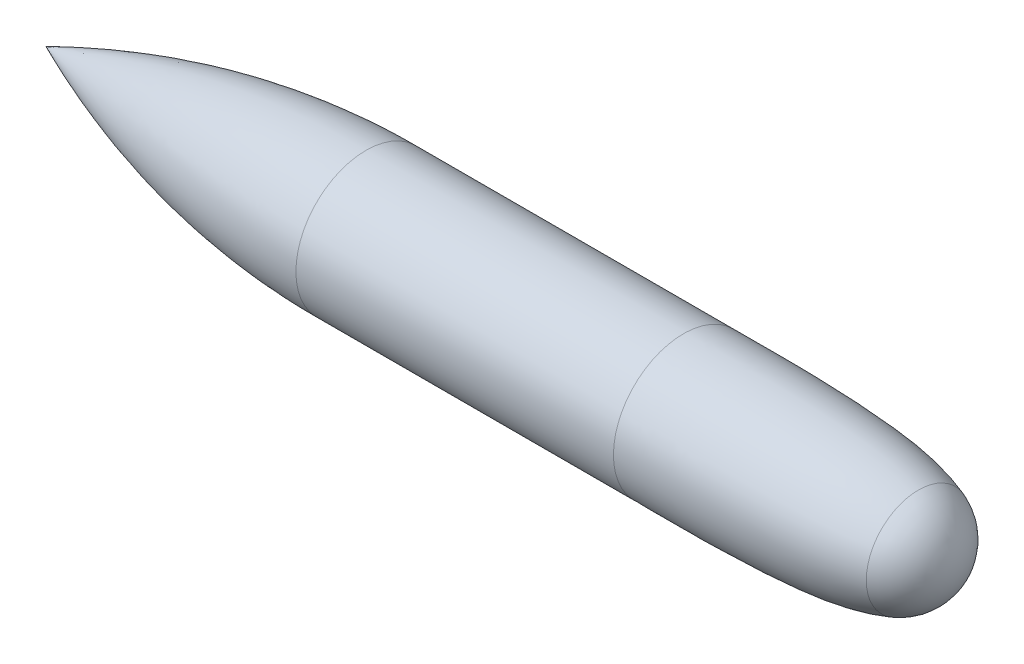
ISO-10303-21;
HEADER;
FILE_DESCRIPTION(('STEP AP214'),'2;1');
FILE_NAME('part.step','',(''),(''),'','','');
FILE_SCHEMA(('AUTOMOTIVE_DESIGN { 1 0 10303 214 1 1 1 1 }'));
ENDSEC;
DATA;
#1=APPLICATION_CONTEXT('core data for automotive mechanical design processes');
#2=APPLICATION_PROTOCOL_DEFINITION('international standard','automotive_design',2000,#1);
#3=PRODUCT_CONTEXT('',#1,'mechanical');
#4=PRODUCT('Part','Part','',(#3));
#5=PRODUCT_RELATED_PRODUCT_CATEGORY('part','',(#4));
#6=PRODUCT_DEFINITION_FORMATION('','',#4);
#7=PRODUCT_DEFINITION_CONTEXT('part definition',#1,'design');
#8=PRODUCT_DEFINITION('design','',#6,#7);
#9=PRODUCT_DEFINITION_SHAPE('','',#8);
#10=(LENGTH_UNIT() NAMED_UNIT(*) SI_UNIT(.MILLI.,.METRE.));
#11=(NAMED_UNIT(*) PLANE_ANGLE_UNIT() SI_UNIT($,.RADIAN.));
#12=(NAMED_UNIT(*) SI_UNIT($,.STERADIAN.) SOLID_ANGLE_UNIT());
#13=UNCERTAINTY_MEASURE_WITH_UNIT(LENGTH_MEASURE(1.E-05),#10,'distance_accuracy_value','');
#14=(GEOMETRIC_REPRESENTATION_CONTEXT(3) GLOBAL_UNCERTAINTY_ASSIGNED_CONTEXT((#13)) GLOBAL_UNIT_ASSIGNED_CONTEXT((#10,
#11,#12)) REPRESENTATION_CONTEXT('',''));
#15=CARTESIAN_POINT('',(0.,0.,0.));
#16=DIRECTION('',(0.,0.,1.));
#17=DIRECTION('',(1.,0.,0.));
#18=AXIS2_PLACEMENT_3D('',#15,#16,#17);
#19=CARTESIAN_POINT('',(1850.39,405.13,0.));
#20=CARTESIAN_POINT('',(1209.47050744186,405.13,0.));
#21=CARTESIAN_POINT('',(585.273449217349,258.505072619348,0.));
#22=CARTESIAN_POINT('',(0.,0.,0.));
#23=B_SPLINE_CURVE_WITH_KNOTS('',3,(#19,#20,#21,#22),.UNSPECIFIED.,.F.,.F.,(4,4),(0.,1.),.UNSPECIFIED.);
#24=CARTESIAN_POINT('',(-1512.64891262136,0.,0.));
#25=DIRECTION('',(-1.,0.,0.));
#26=AXIS1_PLACEMENT('',#24,#25);
#27=SURFACE_OF_REVOLUTION('',#23,#26);
#28=CARTESIAN_POINT('',(0.,0.,0.));
#29=VERTEX_POINT('',#28);
#30=VERTEX_LOOP('',#29);
#31=FACE_BOUND('',#30,.T.);
#32=CARTESIAN_POINT('',(1850.39,0.,0.));
#33=DIRECTION('',(-1.,0.,0.));
#34=DIRECTION('',(0.,0.,1.));
#35=AXIS2_PLACEMENT_3D('',#32,#33,#34);
#36=CIRCLE('',#35,405.13);
#37=CARTESIAN_POINT('',(1850.39,0.,405.13));
#38=VERTEX_POINT('',#37);
#39=EDGE_CURVE('E47',#38,#38,#36,.T.);
#40=ORIENTED_EDGE('',*,*,#39,.T.);
#41=EDGE_LOOP('',(#40));
#42=FACE_BOUND('',#41,.T.);
#43=ADVANCED_FACE('F32',(#31,#42),#27,.T.);
#44=CARTESIAN_POINT('',(4937.79327397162,0.,0.));
#45=DIRECTION('',(-1.,0.,0.));
#46=DIRECTION('',(0.,1.,0.));
#47=AXIS2_PLACEMENT_3D('',#44,#45,#46);
#48=SPHERICAL_SURFACE('',#47,320.006726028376);
#49=CARTESIAN_POINT('',(5045.37811204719,0.,0.));
#50=DIRECTION('',(-1.,0.,0.));
#51=DIRECTION('',(0.,0.,1.));
#52=AXIS2_PLACEMENT_3D('',#49,#50,#51);
#53=CIRCLE('',#52,301.379838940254);
#54=CARTESIAN_POINT('',(5045.37811204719,0.,301.379838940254));
#55=VERTEX_POINT('',#54);
#56=EDGE_CURVE('E11',#55,#55,#53,.T.);
#57=ORIENTED_EDGE('',*,*,#56,.F.);
#58=EDGE_LOOP('',(#57));
#59=FACE_BOUND('',#58,.T.);
#60=ADVANCED_FACE('F44',(#59),#48,.T.);
#61=CARTESIAN_POINT('',(5045.37811204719,301.379838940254,0.));
#62=CARTESIAN_POINT('',(4898.10578917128,353.95226404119,0.));
#63=CARTESIAN_POINT('',(4444.95601981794,411.256271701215,0.));
#64=CARTESIAN_POINT('',(3979.80182322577,405.13,0.));
#65=CARTESIAN_POINT('',(3686.81,405.13,0.));
#66=B_SPLINE_CURVE_WITH_KNOTS('',3,(#61,#62,#63,#64,#65),.UNSPECIFIED.,.F.,.F.,(4,1,4),(0.,
0.339771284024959,1.),.UNSPECIFIED.);
#67=CARTESIAN_POINT('',(-1512.64891262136,0.,0.));
#68=DIRECTION('',(-1.,0.,0.));
#69=AXIS1_PLACEMENT('',#67,#68);
#70=SURFACE_OF_REVOLUTION('',#66,#69);
#71=CARTESIAN_POINT('',(3686.81,0.,0.));
#72=DIRECTION('',(-1.,0.,0.));
#73=DIRECTION('',(0.,0.,1.));
#74=AXIS2_PLACEMENT_3D('',#71,#72,#73);
#75=CIRCLE('',#74,405.13);
#76=CARTESIAN_POINT('',(3686.81,0.,405.13));
#77=VERTEX_POINT('',#76);
#78=EDGE_CURVE('E39',#77,#77,#75,.T.);
#79=ORIENTED_EDGE('',*,*,#78,.F.);
#80=EDGE_LOOP('',(#79));
#81=FACE_BOUND('',#80,.T.);
#82=ORIENTED_EDGE('',*,*,#56,.T.);
#83=EDGE_LOOP('',(#82));
#84=FACE_BOUND('',#83,.T.);
#85=ADVANCED_FACE('F62',(#81,#84),#70,.T.);
#86=CARTESIAN_POINT('',(-1512.64891262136,0.,0.));
#87=DIRECTION('',(-1.,0.,0.));
#88=DIRECTION('',(0.,0.,1.));
#89=AXIS2_PLACEMENT_3D('',#86,#87,#88);
#90=CYLINDRICAL_SURFACE('',#89,405.13);
#91=ORIENTED_EDGE('',*,*,#39,.F.);
#92=EDGE_LOOP('',(#91));
#93=FACE_BOUND('',#92,.T.);
#94=ORIENTED_EDGE('',*,*,#78,.T.);
#95=EDGE_LOOP('',(#94));
#96=FACE_BOUND('',#95,.T.);
#97=ADVANCED_FACE('F65',(#93,#96),#90,.T.);
#98=CLOSED_SHELL('',(#43,#60,#85,#97));
#99=MANIFOLD_SOLID_BREP('B2',#98);
#100=ADVANCED_BREP_SHAPE_REPRESENTATION('',(#18,#99),#14);
#101=SHAPE_DEFINITION_REPRESENTATION(#9,#100);
ENDSEC;
END-ISO-10303-21;
